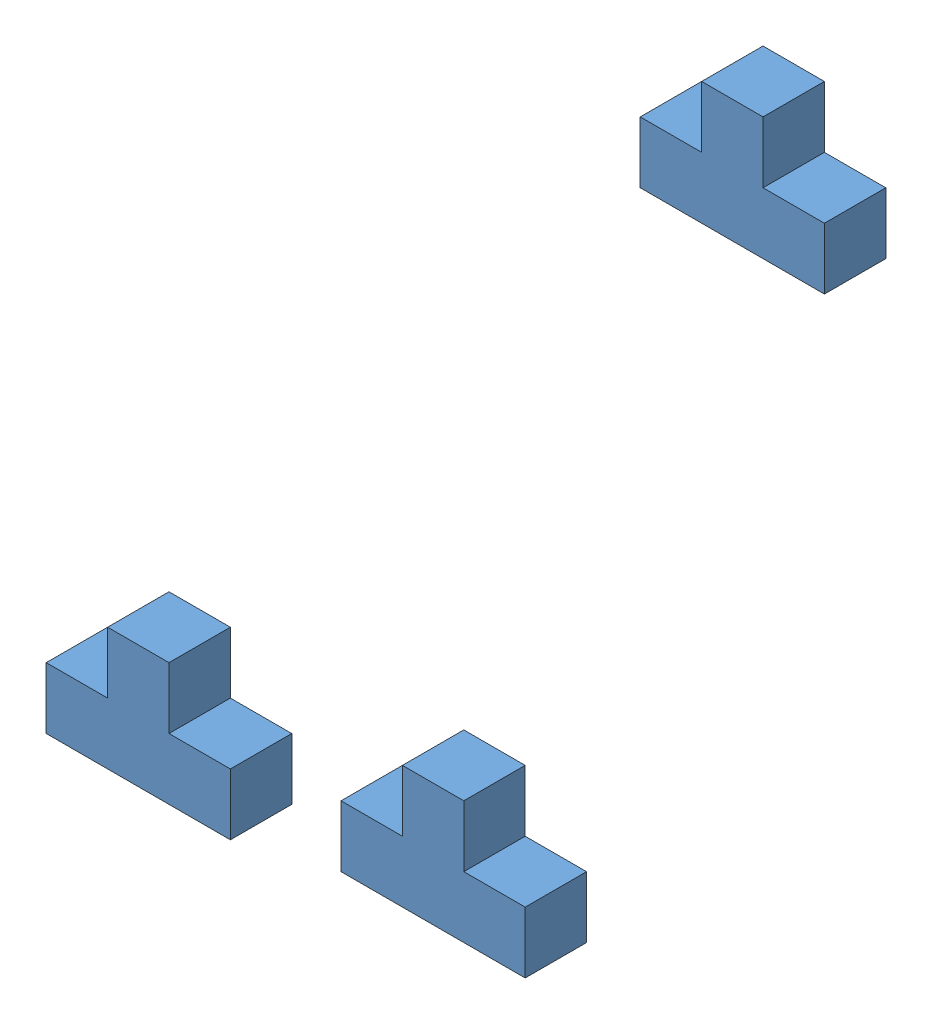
SolidWorks assembly Assemblage1.sldasm, configuration Default (file format 3800). Lengths in mm.
Overall size (336.5 453.52 372.68).
3 component instances, 1 part files, 0 mates.
Components (placement in the parent):
- T Block-1: T Block.SLDPRT [Default] at (25.4543 -44.2749 16.6479) size (152.4 101.6 50.8)
- T Block-2: T Block.SLDPRT [Default] at (-158.642 -7.3758 76.5196) size (152.4 101.6 50.8)
- T Block-3: T Block.SLDPRT [Default] at (11.049 307.6455 -245.3644) size (152.4 101.6 50.8)
